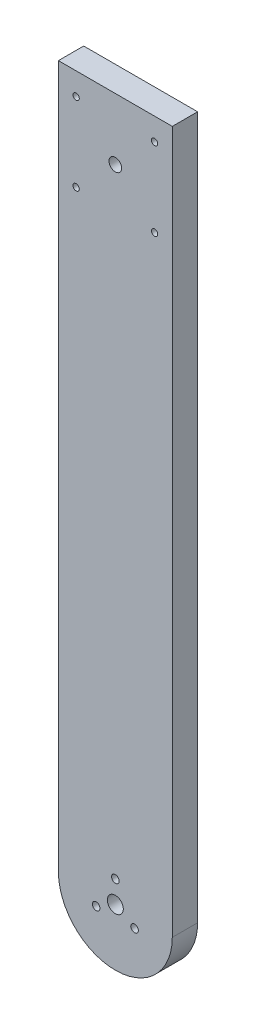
ISO-10303-21;
HEADER;
FILE_DESCRIPTION(('STEP AP214'),'2;1');
FILE_NAME('part.step','',(''),(''),'','','');
FILE_SCHEMA(('AUTOMOTIVE_DESIGN { 1 0 10303 214 1 1 1 1 }'));
ENDSEC;
DATA;
#1=APPLICATION_CONTEXT('core data for automotive mechanical design processes');
#2=APPLICATION_PROTOCOL_DEFINITION('international standard','automotive_design',2000,#1);
#3=PRODUCT_CONTEXT('',#1,'mechanical');
#4=PRODUCT('Part','Part','',(#3));
#5=PRODUCT_RELATED_PRODUCT_CATEGORY('part','',(#4));
#6=PRODUCT_DEFINITION_FORMATION('','',#4);
#7=PRODUCT_DEFINITION_CONTEXT('part definition',#1,'design');
#8=PRODUCT_DEFINITION('design','',#6,#7);
#9=PRODUCT_DEFINITION_SHAPE('','',#8);
#10=(LENGTH_UNIT() NAMED_UNIT(*) SI_UNIT(.MILLI.,.METRE.));
#11=(NAMED_UNIT(*) PLANE_ANGLE_UNIT() SI_UNIT($,.RADIAN.));
#12=(NAMED_UNIT(*) SI_UNIT($,.STERADIAN.) SOLID_ANGLE_UNIT());
#13=UNCERTAINTY_MEASURE_WITH_UNIT(LENGTH_MEASURE(1.E-05),#10,'distance_accuracy_value','');
#14=(GEOMETRIC_REPRESENTATION_CONTEXT(3) GLOBAL_UNCERTAINTY_ASSIGNED_CONTEXT((#13)) GLOBAL_UNIT_ASSIGNED_CONTEXT((#10,
#11,#12)) REPRESENTATION_CONTEXT('',''));
#15=CARTESIAN_POINT('',(0.,0.,0.));
#16=DIRECTION('',(0.,0.,1.));
#17=DIRECTION('',(1.,0.,0.));
#18=AXIS2_PLACEMENT_3D('',#15,#16,#17);
#19=CARTESIAN_POINT('',(-5.086209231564E-12,-147.5,10.));
#20=DIRECTION('',(0.,0.,1.));
#21=DIRECTION('',(1.,0.,0.));
#22=AXIS2_PLACEMENT_3D('',#19,#20,#21);
#23=PLANE('',#22);
#24=CARTESIAN_POINT('',(7.57772228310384,-151.875000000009,10.));
#25=DIRECTION('',(0.,0.,1.));
#26=DIRECTION('',(1.,0.,0.));
#27=AXIS2_PLACEMENT_3D('',#24,#25,#26);
#28=CIRCLE('',#27,1.5);
#29=CARTESIAN_POINT('',(9.07772228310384,-151.875000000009,10.));
#30=VERTEX_POINT('',#29);
#31=EDGE_CURVE('E151',#30,#30,#28,.T.);
#32=ORIENTED_EDGE('',*,*,#31,.F.);
#33=EDGE_LOOP('',(#32));
#34=FACE_BOUND('',#33,.T.);
#35=CARTESIAN_POINT('',(5.46489483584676E-12,-138.75,10.));
#36=DIRECTION('',(0.,0.,1.));
#37=DIRECTION('',(1.,0.,0.));
#38=AXIS2_PLACEMENT_3D('',#35,#36,#37);
#39=CIRCLE('',#38,1.5);
#40=CARTESIAN_POINT('',(1.50000000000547,-138.75,10.));
#41=VERTEX_POINT('',#40);
#42=EDGE_CURVE('E139',#41,#41,#39,.T.);
#43=ORIENTED_EDGE('',*,*,#42,.F.);
#44=EDGE_LOOP('',(#43));
#45=FACE_BOUND('',#44,.T.);
#46=CARTESIAN_POINT('',(-15.4999999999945,90.1639203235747,10.));
#47=DIRECTION('',(0.,0.,1.));
#48=DIRECTION('',(-1.,0.,0.));
#49=AXIS2_PLACEMENT_3D('',#46,#47,#48);
#50=CIRCLE('',#49,1.25);
#51=CARTESIAN_POINT('',(-16.7499999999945,90.1639203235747,10.));
#52=VERTEX_POINT('',#51);
#53=EDGE_CURVE('E127',#52,#52,#50,.T.);
#54=ORIENTED_EDGE('',*,*,#53,.F.);
#55=EDGE_LOOP('',(#54));
#56=FACE_BOUND('',#55,.T.);
#57=CARTESIAN_POINT('',(15.5000000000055,121.163920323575,10.));
#58=DIRECTION('',(0.,0.,1.));
#59=DIRECTION('',(-1.,0.,0.));
#60=AXIS2_PLACEMENT_3D('',#57,#58,#59);
#61=CIRCLE('',#60,1.25);
#62=CARTESIAN_POINT('',(14.2500000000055,121.163920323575,10.));
#63=VERTEX_POINT('',#62);
#64=EDGE_CURVE('E115',#63,#63,#61,.T.);
#65=ORIENTED_EDGE('',*,*,#64,.F.);
#66=EDGE_LOOP('',(#65));
#67=FACE_BOUND('',#66,.T.);
#68=DIRECTION('',(0.,-1.,0.));
#69=VECTOR('',#68,1.);
#70=CARTESIAN_POINT('',(-22.5,130.,10.));
#71=LINE('',#70,#69);
#72=CARTESIAN_POINT('',(-22.5,130.,10.));
#73=VERTEX_POINT('',#72);
#74=CARTESIAN_POINT('',(-22.5000000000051,-147.5,10.));
#75=VERTEX_POINT('',#74);
#76=EDGE_CURVE('E85',#73,#75,#71,.T.);
#77=ORIENTED_EDGE('',*,*,#76,.T.);
#78=CARTESIAN_POINT('',(-5.086209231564E-12,-147.5,10.));
#79=DIRECTION('',(0.,0.,1.));
#80=DIRECTION('',(1.,0.,0.));
#81=AXIS2_PLACEMENT_3D('',#78,#79,#80);
#82=CIRCLE('',#81,22.5);
#83=CARTESIAN_POINT('',(22.4999999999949,-147.5,10.));
#84=VERTEX_POINT('',#83);
#85=EDGE_CURVE('E80',#75,#84,#82,.T.);
#86=ORIENTED_EDGE('',*,*,#85,.T.);
#87=DIRECTION('',(0.,1.,0.));
#88=VECTOR('',#87,1.);
#89=CARTESIAN_POINT('',(22.5,130.,10.));
#90=LINE('',#89,#88);
#91=CARTESIAN_POINT('',(22.5,130.,10.));
#92=VERTEX_POINT('',#91);
#93=EDGE_CURVE('E83',#84,#92,#90,.T.);
#94=ORIENTED_EDGE('',*,*,#93,.T.);
#95=DIRECTION('',(-1.,0.,0.));
#96=VECTOR('',#95,1.);
#97=CARTESIAN_POINT('',(-22.5,130.,10.));
#98=LINE('',#97,#96);
#99=EDGE_CURVE('E50',#92,#73,#98,.T.);
#100=ORIENTED_EDGE('',*,*,#99,.T.);
#101=EDGE_LOOP('',(#77,#86,#94,#100));
#102=FACE_BOUND('',#101,.T.);
#103=CARTESIAN_POINT('',(-15.4999999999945,121.163920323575,10.));
#104=DIRECTION('',(0.,0.,1.));
#105=DIRECTION('',(1.,0.,0.));
#106=AXIS2_PLACEMENT_3D('',#103,#104,#105);
#107=CIRCLE('',#106,1.25);
#108=CARTESIAN_POINT('',(-14.2499999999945,121.163920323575,10.));
#109=VERTEX_POINT('',#108);
#110=EDGE_CURVE('E100',#109,#109,#107,.T.);
#111=ORIENTED_EDGE('',*,*,#110,.F.);
#112=EDGE_LOOP('',(#111));
#113=FACE_BOUND('',#112,.T.);
#114=CARTESIAN_POINT('',(15.5000000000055,90.1639203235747,10.));
#115=DIRECTION('',(0.,0.,1.));
#116=DIRECTION('',(1.,0.,0.));
#117=AXIS2_PLACEMENT_3D('',#114,#115,#116);
#118=CIRCLE('',#117,1.25);
#119=CARTESIAN_POINT('',(16.7500000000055,90.1639203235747,10.));
#120=VERTEX_POINT('',#119);
#121=EDGE_CURVE('E121',#120,#120,#118,.T.);
#122=ORIENTED_EDGE('',*,*,#121,.F.);
#123=EDGE_LOOP('',(#122));
#124=FACE_BOUND('',#123,.T.);
#125=CARTESIAN_POINT('',(5.4678483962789E-12,105.663920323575,10.));
#126=DIRECTION('',(0.,0.,1.));
#127=DIRECTION('',(1.,0.,0.));
#128=AXIS2_PLACEMENT_3D('',#125,#126,#127);
#129=CIRCLE('',#128,2.5);
#130=CARTESIAN_POINT('',(2.50000000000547,105.663920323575,10.));
#131=VERTEX_POINT('',#130);
#132=EDGE_CURVE('E133',#131,#131,#129,.T.);
#133=ORIENTED_EDGE('',*,*,#132,.F.);
#134=EDGE_LOOP('',(#133));
#135=FACE_BOUND('',#134,.T.);
#136=CARTESIAN_POINT('',(-5.086209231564E-12,-147.5,10.));
#137=DIRECTION('',(0.,0.,1.));
#138=DIRECTION('',(1.,0.,0.));
#139=AXIS2_PLACEMENT_3D('',#136,#137,#138);
#140=CIRCLE('',#139,3.15);
#141=CARTESIAN_POINT('',(3.14999999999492,-147.5,10.));
#142=VERTEX_POINT('',#141);
#143=EDGE_CURVE('E145',#142,#142,#140,.T.);
#144=ORIENTED_EDGE('',*,*,#143,.F.);
#145=EDGE_LOOP('',(#144));
#146=FACE_BOUND('',#145,.T.);
#147=CARTESIAN_POINT('',(-7.57772228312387,-151.874999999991,10.));
#148=DIRECTION('',(0.,0.,1.));
#149=DIRECTION('',(1.,0.,0.));
#150=AXIS2_PLACEMENT_3D('',#147,#148,#149);
#151=CIRCLE('',#150,1.49999999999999);
#152=CARTESIAN_POINT('',(-6.07772228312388,-151.874999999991,10.));
#153=VERTEX_POINT('',#152);
#154=EDGE_CURVE('E157',#153,#153,#151,.T.);
#155=ORIENTED_EDGE('',*,*,#154,.F.);
#156=EDGE_LOOP('',(#155));
#157=FACE_BOUND('',#156,.T.);
#158=ADVANCED_FACE('F33',(#34,#45,#56,#67,#102,#113,#124,#135,#146,#157),#23,.T.);
#159=CARTESIAN_POINT('',(-5.086209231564E-12,-147.5,0.));
#160=DIRECTION('',(0.,0.,1.));
#161=DIRECTION('',(1.,0.,0.));
#162=AXIS2_PLACEMENT_3D('',#159,#160,#161);
#163=PLANE('',#162);
#164=DIRECTION('',(0.,-1.,0.));
#165=VECTOR('',#164,1.);
#166=CARTESIAN_POINT('',(-22.5,130.,0.));
#167=LINE('',#166,#165);
#168=CARTESIAN_POINT('',(-22.5,130.,0.));
#169=VERTEX_POINT('',#168);
#170=CARTESIAN_POINT('',(-22.5000000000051,-147.5,0.));
#171=VERTEX_POINT('',#170);
#172=EDGE_CURVE('E97',#169,#171,#167,.T.);
#173=ORIENTED_EDGE('',*,*,#172,.F.);
#174=DIRECTION('',(-1.,0.,0.));
#175=VECTOR('',#174,1.);
#176=CARTESIAN_POINT('',(-22.5,130.,0.));
#177=LINE('',#176,#175);
#178=CARTESIAN_POINT('',(22.5,130.,0.));
#179=VERTEX_POINT('',#178);
#180=EDGE_CURVE('E73',#179,#169,#177,.T.);
#181=ORIENTED_EDGE('',*,*,#180,.F.);
#182=DIRECTION('',(0.,1.,0.));
#183=VECTOR('',#182,1.);
#184=CARTESIAN_POINT('',(22.5,130.,0.));
#185=LINE('',#184,#183);
#186=CARTESIAN_POINT('',(22.4999999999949,-147.5,0.));
#187=VERTEX_POINT('',#186);
#188=EDGE_CURVE('E67',#187,#179,#185,.T.);
#189=ORIENTED_EDGE('',*,*,#188,.F.);
#190=CARTESIAN_POINT('',(-5.086209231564E-12,-147.5,0.));
#191=DIRECTION('',(0.,0.,1.));
#192=DIRECTION('',(1.,0.,0.));
#193=AXIS2_PLACEMENT_3D('',#190,#191,#192);
#194=CIRCLE('',#193,22.5);
#195=EDGE_CURVE('E89',#171,#187,#194,.T.);
#196=ORIENTED_EDGE('',*,*,#195,.F.);
#197=EDGE_LOOP('',(#173,#181,#189,#196));
#198=FACE_BOUND('',#197,.T.);
#199=CARTESIAN_POINT('',(-15.4999999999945,121.163920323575,0.));
#200=DIRECTION('',(0.,0.,1.));
#201=DIRECTION('',(1.,0.,0.));
#202=AXIS2_PLACEMENT_3D('',#199,#200,#201);
#203=CIRCLE('',#202,1.25);
#204=CARTESIAN_POINT('',(-14.2499999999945,121.163920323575,0.));
#205=VERTEX_POINT('',#204);
#206=EDGE_CURVE('E112',#205,#205,#203,.T.);
#207=ORIENTED_EDGE('',*,*,#206,.T.);
#208=EDGE_LOOP('',(#207));
#209=FACE_BOUND('',#208,.T.);
#210=CARTESIAN_POINT('',(15.5000000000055,121.163920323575,0.));
#211=DIRECTION('',(0.,0.,1.));
#212=DIRECTION('',(-1.,0.,0.));
#213=AXIS2_PLACEMENT_3D('',#210,#211,#212);
#214=CIRCLE('',#213,1.25);
#215=CARTESIAN_POINT('',(14.2500000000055,121.163920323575,0.));
#216=VERTEX_POINT('',#215);
#217=EDGE_CURVE('E118',#216,#216,#214,.T.);
#218=ORIENTED_EDGE('',*,*,#217,.T.);
#219=EDGE_LOOP('',(#218));
#220=FACE_BOUND('',#219,.T.);
#221=CARTESIAN_POINT('',(15.5000000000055,90.1639203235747,0.));
#222=DIRECTION('',(0.,0.,1.));
#223=DIRECTION('',(1.,0.,0.));
#224=AXIS2_PLACEMENT_3D('',#221,#222,#223);
#225=CIRCLE('',#224,1.25);
#226=CARTESIAN_POINT('',(16.7500000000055,90.1639203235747,0.));
#227=VERTEX_POINT('',#226);
#228=EDGE_CURVE('E124',#227,#227,#225,.T.);
#229=ORIENTED_EDGE('',*,*,#228,.T.);
#230=EDGE_LOOP('',(#229));
#231=FACE_BOUND('',#230,.T.);
#232=CARTESIAN_POINT('',(-15.4999999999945,90.1639203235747,0.));
#233=DIRECTION('',(0.,0.,1.));
#234=DIRECTION('',(-1.,0.,0.));
#235=AXIS2_PLACEMENT_3D('',#232,#233,#234);
#236=CIRCLE('',#235,1.25);
#237=CARTESIAN_POINT('',(-16.7499999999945,90.1639203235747,0.));
#238=VERTEX_POINT('',#237);
#239=EDGE_CURVE('E130',#238,#238,#236,.T.);
#240=ORIENTED_EDGE('',*,*,#239,.T.);
#241=EDGE_LOOP('',(#240));
#242=FACE_BOUND('',#241,.T.);
#243=CARTESIAN_POINT('',(5.4678483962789E-12,105.663920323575,0.));
#244=DIRECTION('',(0.,0.,1.));
#245=DIRECTION('',(1.,0.,0.));
#246=AXIS2_PLACEMENT_3D('',#243,#244,#245);
#247=CIRCLE('',#246,2.5);
#248=CARTESIAN_POINT('',(2.50000000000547,105.663920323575,0.));
#249=VERTEX_POINT('',#248);
#250=EDGE_CURVE('E136',#249,#249,#247,.T.);
#251=ORIENTED_EDGE('',*,*,#250,.T.);
#252=EDGE_LOOP('',(#251));
#253=FACE_BOUND('',#252,.T.);
#254=CARTESIAN_POINT('',(5.46489483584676E-12,-138.75,0.));
#255=DIRECTION('',(0.,0.,1.));
#256=DIRECTION('',(1.,0.,0.));
#257=AXIS2_PLACEMENT_3D('',#254,#255,#256);
#258=CIRCLE('',#257,1.5);
#259=CARTESIAN_POINT('',(1.50000000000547,-138.75,0.));
#260=VERTEX_POINT('',#259);
#261=EDGE_CURVE('E142',#260,#260,#258,.T.);
#262=ORIENTED_EDGE('',*,*,#261,.T.);
#263=EDGE_LOOP('',(#262));
#264=FACE_BOUND('',#263,.T.);
#265=CARTESIAN_POINT('',(-5.086209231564E-12,-147.5,0.));
#266=DIRECTION('',(0.,0.,1.));
#267=DIRECTION('',(1.,0.,0.));
#268=AXIS2_PLACEMENT_3D('',#265,#266,#267);
#269=CIRCLE('',#268,3.15);
#270=CARTESIAN_POINT('',(3.14999999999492,-147.5,0.));
#271=VERTEX_POINT('',#270);
#272=EDGE_CURVE('E148',#271,#271,#269,.T.);
#273=ORIENTED_EDGE('',*,*,#272,.T.);
#274=EDGE_LOOP('',(#273));
#275=FACE_BOUND('',#274,.T.);
#276=CARTESIAN_POINT('',(7.57772228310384,-151.875000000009,0.));
#277=DIRECTION('',(0.,0.,1.));
#278=DIRECTION('',(1.,0.,0.));
#279=AXIS2_PLACEMENT_3D('',#276,#277,#278);
#280=CIRCLE('',#279,1.5);
#281=CARTESIAN_POINT('',(9.07772228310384,-151.875000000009,0.));
#282=VERTEX_POINT('',#281);
#283=EDGE_CURVE('E154',#282,#282,#280,.T.);
#284=ORIENTED_EDGE('',*,*,#283,.T.);
#285=EDGE_LOOP('',(#284));
#286=FACE_BOUND('',#285,.T.);
#287=CARTESIAN_POINT('',(-7.57772228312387,-151.874999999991,0.));
#288=DIRECTION('',(0.,0.,1.));
#289=DIRECTION('',(1.,0.,0.));
#290=AXIS2_PLACEMENT_3D('',#287,#288,#289);
#291=CIRCLE('',#290,1.49999999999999);
#292=CARTESIAN_POINT('',(-6.07772228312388,-151.874999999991,0.));
#293=VERTEX_POINT('',#292);
#294=EDGE_CURVE('E160',#293,#293,#291,.T.);
#295=ORIENTED_EDGE('',*,*,#294,.T.);
#296=EDGE_LOOP('',(#295));
#297=FACE_BOUND('',#296,.T.);
#298=ADVANCED_FACE('F108',(#198,#209,#220,#231,#242,#253,#264,#275,#286,#297),#163,.F.);
#299=CARTESIAN_POINT('',(-22.5,130.,10.));
#300=DIRECTION('',(1.,0.,0.));
#301=DIRECTION('',(0.,1.,0.));
#302=AXIS2_PLACEMENT_3D('',#299,#300,#301);
#303=PLANE('',#302);
#304=ORIENTED_EDGE('',*,*,#172,.T.);
#305=DIRECTION('',(0.,0.,-1.));
#306=VECTOR('',#305,1.);
#307=CARTESIAN_POINT('',(-22.5000000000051,-147.5,10.));
#308=LINE('',#307,#306);
#309=EDGE_CURVE('E11',#75,#171,#308,.T.);
#310=ORIENTED_EDGE('',*,*,#309,.F.);
#311=ORIENTED_EDGE('',*,*,#76,.F.);
#312=DIRECTION('',(0.,0.,-1.));
#313=VECTOR('',#312,1.);
#314=CARTESIAN_POINT('',(-22.5,130.,10.));
#315=LINE('',#314,#313);
#316=EDGE_CURVE('E93',#73,#169,#315,.T.);
#317=ORIENTED_EDGE('',*,*,#316,.T.);
#318=EDGE_LOOP('',(#304,#310,#311,#317));
#319=FACE_BOUND('',#318,.T.);
#320=ADVANCED_FACE('F35',(#319),#303,.F.);
#321=CARTESIAN_POINT('',(-5.086209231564E-12,-147.5,10.));
#322=DIRECTION('',(0.,0.,-1.));
#323=DIRECTION('',(-1.,0.,0.));
#324=AXIS2_PLACEMENT_3D('',#321,#322,#323);
#325=CYLINDRICAL_SURFACE('',#324,22.5);
#326=ORIENTED_EDGE('',*,*,#195,.T.);
#327=DIRECTION('',(0.,0.,-1.));
#328=VECTOR('',#327,1.);
#329=CARTESIAN_POINT('',(22.4999999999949,-147.5,10.));
#330=LINE('',#329,#328);
#331=EDGE_CURVE('E42',#84,#187,#330,.T.);
#332=ORIENTED_EDGE('',*,*,#331,.F.);
#333=ORIENTED_EDGE('',*,*,#85,.F.);
#334=ORIENTED_EDGE('',*,*,#309,.T.);
#335=EDGE_LOOP('',(#326,#332,#333,#334));
#336=FACE_BOUND('',#335,.T.);
#337=ADVANCED_FACE('F88',(#336),#325,.T.);
#338=CARTESIAN_POINT('',(22.5,130.,10.));
#339=DIRECTION('',(-1.,0.,0.));
#340=DIRECTION('',(0.,-1.,0.));
#341=AXIS2_PLACEMENT_3D('',#338,#339,#340);
#342=PLANE('',#341);
#343=ORIENTED_EDGE('',*,*,#188,.T.);
#344=DIRECTION('',(0.,0.,-1.));
#345=VECTOR('',#344,1.);
#346=CARTESIAN_POINT('',(22.5,130.,10.));
#347=LINE('',#346,#345);
#348=EDGE_CURVE('E90',#92,#179,#347,.T.);
#349=ORIENTED_EDGE('',*,*,#348,.F.);
#350=ORIENTED_EDGE('',*,*,#93,.F.);
#351=ORIENTED_EDGE('',*,*,#331,.T.);
#352=EDGE_LOOP('',(#343,#349,#350,#351));
#353=FACE_BOUND('',#352,.T.);
#354=ADVANCED_FACE('F91',(#353),#342,.F.);
#355=CARTESIAN_POINT('',(-22.5,130.,10.));
#356=DIRECTION('',(0.,-1.,0.));
#357=DIRECTION('',(0.,0.,-1.));
#358=AXIS2_PLACEMENT_3D('',#355,#356,#357);
#359=PLANE('',#358);
#360=ORIENTED_EDGE('',*,*,#180,.T.);
#361=ORIENTED_EDGE('',*,*,#316,.F.);
#362=ORIENTED_EDGE('',*,*,#99,.F.);
#363=ORIENTED_EDGE('',*,*,#348,.T.);
#364=EDGE_LOOP('',(#360,#361,#362,#363));
#365=FACE_BOUND('',#364,.T.);
#366=ADVANCED_FACE('F105',(#365),#359,.F.);
#367=CARTESIAN_POINT('',(-15.4999999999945,121.163920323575,10.));
#368=DIRECTION('',(0.,0.,-1.));
#369=DIRECTION('',(-1.,0.,0.));
#370=AXIS2_PLACEMENT_3D('',#367,#368,#369);
#371=CYLINDRICAL_SURFACE('',#370,1.25);
#372=ORIENTED_EDGE('',*,*,#110,.T.);
#373=EDGE_LOOP('',(#372));
#374=FACE_BOUND('',#373,.T.);
#375=ORIENTED_EDGE('',*,*,#206,.F.);
#376=EDGE_LOOP('',(#375));
#377=FACE_BOUND('',#376,.T.);
#378=ADVANCED_FACE('F179',(#374,#377),#371,.F.);
#379=CARTESIAN_POINT('',(15.5000000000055,121.163920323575,10.));
#380=DIRECTION('',(0.,0.,-1.));
#381=DIRECTION('',(-1.,0.,0.));
#382=AXIS2_PLACEMENT_3D('',#379,#380,#381);
#383=CYLINDRICAL_SURFACE('',#382,1.25);
#384=ORIENTED_EDGE('',*,*,#64,.T.);
#385=EDGE_LOOP('',(#384));
#386=FACE_BOUND('',#385,.T.);
#387=ORIENTED_EDGE('',*,*,#217,.F.);
#388=EDGE_LOOP('',(#387));
#389=FACE_BOUND('',#388,.T.);
#390=ADVANCED_FACE('F225',(#386,#389),#383,.F.);
#391=CARTESIAN_POINT('',(15.5000000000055,90.1639203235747,10.));
#392=DIRECTION('',(0.,0.,-1.));
#393=DIRECTION('',(-1.,0.,0.));
#394=AXIS2_PLACEMENT_3D('',#391,#392,#393);
#395=CYLINDRICAL_SURFACE('',#394,1.25);
#396=ORIENTED_EDGE('',*,*,#121,.T.);
#397=EDGE_LOOP('',(#396));
#398=FACE_BOUND('',#397,.T.);
#399=ORIENTED_EDGE('',*,*,#228,.F.);
#400=EDGE_LOOP('',(#399));
#401=FACE_BOUND('',#400,.T.);
#402=ADVANCED_FACE('F233',(#398,#401),#395,.F.);
#403=CARTESIAN_POINT('',(-15.4999999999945,90.1639203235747,10.));
#404=DIRECTION('',(0.,0.,-1.));
#405=DIRECTION('',(-1.,0.,0.));
#406=AXIS2_PLACEMENT_3D('',#403,#404,#405);
#407=CYLINDRICAL_SURFACE('',#406,1.25);
#408=ORIENTED_EDGE('',*,*,#53,.T.);
#409=EDGE_LOOP('',(#408));
#410=FACE_BOUND('',#409,.T.);
#411=ORIENTED_EDGE('',*,*,#239,.F.);
#412=EDGE_LOOP('',(#411));
#413=FACE_BOUND('',#412,.T.);
#414=ADVANCED_FACE('F241',(#410,#413),#407,.F.);
#415=CARTESIAN_POINT('',(5.4678483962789E-12,105.663920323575,10.));
#416=DIRECTION('',(0.,0.,-1.));
#417=DIRECTION('',(-1.,0.,0.));
#418=AXIS2_PLACEMENT_3D('',#415,#416,#417);
#419=CYLINDRICAL_SURFACE('',#418,2.5);
#420=ORIENTED_EDGE('',*,*,#132,.T.);
#421=EDGE_LOOP('',(#420));
#422=FACE_BOUND('',#421,.T.);
#423=ORIENTED_EDGE('',*,*,#250,.F.);
#424=EDGE_LOOP('',(#423));
#425=FACE_BOUND('',#424,.T.);
#426=ADVANCED_FACE('F250',(#422,#425),#419,.F.);
#427=CARTESIAN_POINT('',(5.46489483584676E-12,-138.75,10.));
#428=DIRECTION('',(0.,0.,-1.));
#429=DIRECTION('',(-1.,0.,0.));
#430=AXIS2_PLACEMENT_3D('',#427,#428,#429);
#431=CYLINDRICAL_SURFACE('',#430,1.5);
#432=ORIENTED_EDGE('',*,*,#42,.T.);
#433=EDGE_LOOP('',(#432));
#434=FACE_BOUND('',#433,.T.);
#435=ORIENTED_EDGE('',*,*,#261,.F.);
#436=EDGE_LOOP('',(#435));
#437=FACE_BOUND('',#436,.T.);
#438=ADVANCED_FACE('F259',(#434,#437),#431,.F.);
#439=CARTESIAN_POINT('',(-5.086209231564E-12,-147.5,10.));
#440=DIRECTION('',(0.,0.,-1.));
#441=DIRECTION('',(-1.,0.,0.));
#442=AXIS2_PLACEMENT_3D('',#439,#440,#441);
#443=CYLINDRICAL_SURFACE('',#442,3.15);
#444=ORIENTED_EDGE('',*,*,#143,.T.);
#445=EDGE_LOOP('',(#444));
#446=FACE_BOUND('',#445,.T.);
#447=ORIENTED_EDGE('',*,*,#272,.F.);
#448=EDGE_LOOP('',(#447));
#449=FACE_BOUND('',#448,.T.);
#450=ADVANCED_FACE('F268',(#446,#449),#443,.F.);
#451=CARTESIAN_POINT('',(7.57772228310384,-151.875000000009,10.));
#452=DIRECTION('',(0.,0.,-1.));
#453=DIRECTION('',(-1.,0.,0.));
#454=AXIS2_PLACEMENT_3D('',#451,#452,#453);
#455=CYLINDRICAL_SURFACE('',#454,1.5);
#456=ORIENTED_EDGE('',*,*,#31,.T.);
#457=EDGE_LOOP('',(#456));
#458=FACE_BOUND('',#457,.T.);
#459=ORIENTED_EDGE('',*,*,#283,.F.);
#460=EDGE_LOOP('',(#459));
#461=FACE_BOUND('',#460,.T.);
#462=ADVANCED_FACE('F277',(#458,#461),#455,.F.);
#463=CARTESIAN_POINT('',(-7.57772228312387,-151.874999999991,10.));
#464=DIRECTION('',(0.,0.,-1.));
#465=DIRECTION('',(-1.,0.,0.));
#466=AXIS2_PLACEMENT_3D('',#463,#464,#465);
#467=CYLINDRICAL_SURFACE('',#466,1.49999999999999);
#468=ORIENTED_EDGE('',*,*,#154,.T.);
#469=EDGE_LOOP('',(#468));
#470=FACE_BOUND('',#469,.T.);
#471=ORIENTED_EDGE('',*,*,#294,.F.);
#472=EDGE_LOOP('',(#471));
#473=FACE_BOUND('',#472,.T.);
#474=ADVANCED_FACE('F166',(#470,#473),#467,.F.);
#475=CLOSED_SHELL('',(#158,#298,#320,#337,#354,#366,#378,#390,#402,#414,#426,#438,#450,#462,#474));
#476=MANIFOLD_SOLID_BREP('B2',#475);
#477=ADVANCED_BREP_SHAPE_REPRESENTATION('',(#18,#476),#14);
#478=SHAPE_DEFINITION_REPRESENTATION(#9,#477);
ENDSEC;
END-ISO-10303-21;
